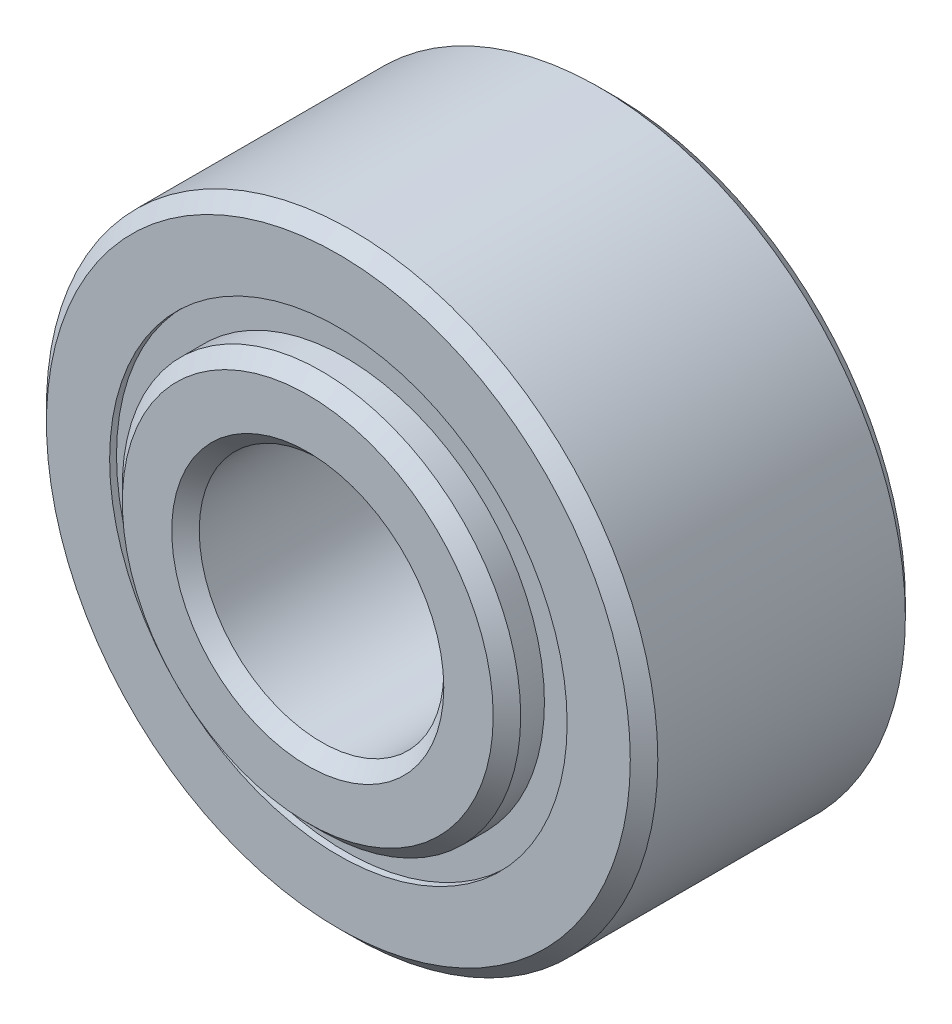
from build123d import *

# Parameters (mm, degrees)
CIRPATTERN1_COUNT = 10
SKETCH5_W         = 0.879852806
SKETCH5_H         = 0.383847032


with BuildPart() as part:
    # Sketch1 → Revolve1 (revolve)
    with BuildSketch(Plane(origin=(0, 0, 0), x_dir=(0, 0, -1), z_dir=(1, 0, 0)), mode=Mode.PRIVATE) as revolve1_sk:
        with BuildLine():
            Line((1.607058, 3.96875), (-1.607058, 3.96875))
            Line((-1.607058, 3.96875), (-1.78562, 3.790188))
            Line((-1.78562, 3.790188), (-1.78562, 2.970048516))
            Line((-1.78562, 2.970048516), (-0.793608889, 2.970048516))
            ThreePointArc((-0.793608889, 2.970048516), (0, 3.594611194), (0.793608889, 2.970048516))
            Line((0.793608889, 2.970048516), (1.78562, 2.970048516))
            Line((1.78562, 2.970048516), (1.78562, 3.790188))
            Line((1.78562, 3.790188), (1.607058, 3.96875))
        make_face()
    revolve(revolve1_sk.sketch.rotate(Axis((0, 0, 1.78562), (0, 0, -1)), 90), axis=Axis((0, 0, 1.78562), (0, 0, -1)))


with BuildPart() as body_2:
    # Sketch3 → Revolve3 (revolve)
    with BuildSketch(Plane(origin=(0, 0, 0), x_dir=(0, 0, -1), z_dir=(1, 0, 0)), mode=Mode.PRIVATE) as revolve3_sk:
        with BuildLine():
            Line((-2.18313, 1.766062), (-2.18313, 2.407639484))
            Line((-2.18313, 2.407639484), (-2.004568, 2.586201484))
            Line((-2.004568, 2.586201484), (-0.793608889, 2.586201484))
            ThreePointArc((-0.793608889, 2.586201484), (0, 1.961638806), (0.793608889, 2.586201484))
            Line((0.793608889, 2.586201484), (2.004568, 2.586201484))
            Line((2.004568, 2.586201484), (2.18313, 2.407639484))
            Line((2.18313, 2.407639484), (2.18313, 1.766062))
            Line((2.18313, 1.766062), (2.004568, 1.5875))
            Line((2.004568, 1.5875), (-2.004568, 1.5875))
            Line((-2.004568, 1.5875), (-2.18313, 1.766062))
        make_face()
    revolve(revolve3_sk.sketch.rotate(Axis((0, 0, 1.78562), (0, 0, -1)), 90), axis=Axis((0, 0, 1.78562), (0, 0, -1)))


with BuildPart() as body_3:
    # Sketch4 → Revolve4 (revolve)
    with BuildSketch(Plane(origin=(0, 0, 0), x_dir=(0, 0, -1), z_dir=(1, 0, 0))):
        with BuildLine():
            Line((-0.816486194, 2.778125), (0.816486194, 2.778125))
            ThreePointArc((0.816486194, 2.778125), (0, 3.594611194), (-0.816486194, 2.778125))
        make_face()
    revolve(axis=Axis((0, 2.778125, 0.816486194), (0, 0, -1)))


with BuildPart() as cirpattern1_1:
    # CirPattern1: pattern copy
    add(body_3.part.rotate(Axis((0, 0, 0), (0, 0, 1)), 1 * 360 / CIRPATTERN1_COUNT))


with BuildPart() as cirpattern1_2:
    # CirPattern1: pattern copy
    add(body_3.part.rotate(Axis((0, 0, 0), (0, 0, 1)), 2 * 360 / CIRPATTERN1_COUNT))


with BuildPart() as cirpattern1_3:
    # CirPattern1: pattern copy
    add(body_3.part.rotate(Axis((0, 0, 0), (0, 0, 1)), 3 * 360 / CIRPATTERN1_COUNT))


with BuildPart() as cirpattern1_4:
    # CirPattern1: pattern copy
    add(body_3.part.rotate(Axis((0, 0, 0), (0, 0, 1)), 4 * 360 / CIRPATTERN1_COUNT))


with BuildPart() as cirpattern1_5:
    # CirPattern1: pattern copy
    add(body_3.part.rotate(Axis((0, 0, 0), (0, 0, 1)), 5 * 360 / CIRPATTERN1_COUNT))


with BuildPart() as cirpattern1_6:
    # CirPattern1: pattern copy
    add(body_3.part.rotate(Axis((0, 0, 0), (0, 0, 1)), 6 * 360 / CIRPATTERN1_COUNT))


with BuildPart() as cirpattern1_7:
    # CirPattern1: pattern copy
    add(body_3.part.rotate(Axis((0, 0, 0), (0, 0, 1)), 7 * 360 / CIRPATTERN1_COUNT))


with BuildPart() as cirpattern1_8:
    # CirPattern1: pattern copy
    add(body_3.part.rotate(Axis((0, 0, 0), (0, 0, 1)), 8 * 360 / CIRPATTERN1_COUNT))


with BuildPart() as cirpattern1_9:
    # CirPattern1: pattern copy
    add(body_3.part.rotate(Axis((0, 0, 0), (0, 0, 1)), 9 * 360 / CIRPATTERN1_COUNT))


with BuildPart() as body_13:
    # Sketch5 → Revolve5 (revolve)
    with BuildSketch(Plane(origin=(0, 0, 0), x_dir=(0, 0, -1), z_dir=(1, 0, 0)), mode=Mode.PRIVATE) as revolve5_sk:
        with Locations((-1.256412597, 2.778125)):
            Rectangle(SKETCH5_W, SKETCH5_H)
        with Locations((1.256412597, 2.778125)):
            Rectangle(SKETCH5_W, SKETCH5_H)
    revolve(revolve5_sk.sketch.rotate(Axis((0, 0, 1.78562), (0, 0, -1)), 90), axis=Axis((0, 0, 1.78562), (0, 0, -1)))


solid = Compound([part.part, body_2.part, body_3.part, cirpattern1_1.part, cirpattern1_2.part, cirpattern1_3.part, cirpattern1_4.part, cirpattern1_5.part, cirpattern1_6.part, cirpattern1_7.part, cirpattern1_8.part, cirpattern1_9.part, body_13.part])
